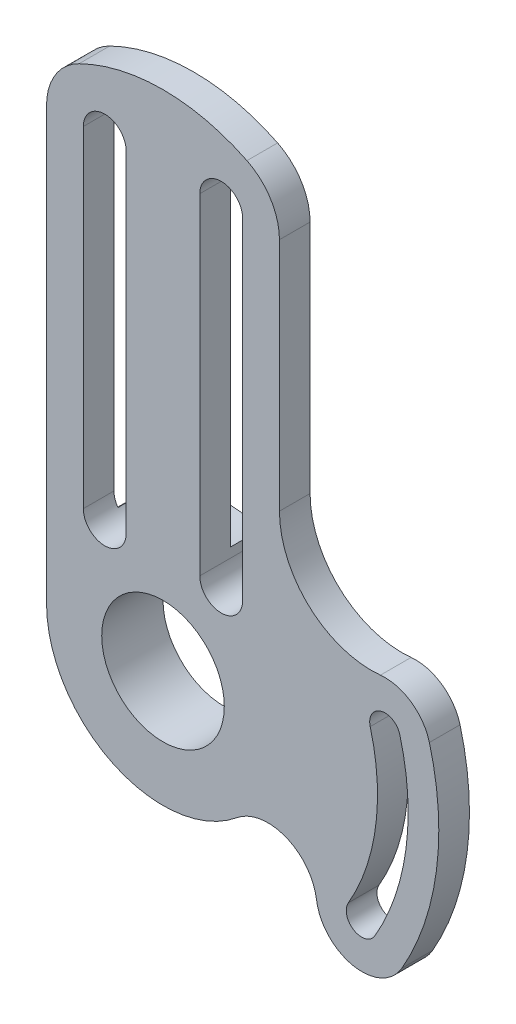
from build123d import *
from build123d.topology import SkipClean

# Parameters (mm, degrees)
ESQUISSE1_R             = 20
BOSS_EXTRU_1_DEPTH      = 10
BOSS_EXTRU_2_START      = 10
ESQUISSE3_R             = 38
ESQUISSE3_R_2           = 20
BOSS_EXTRU_2_DEPTH      = 10
ENL_V_MAT_EXTRU_1_DEPTH = 140.61692504


with BuildPart() as part:
    # Esquisse1 → Boss.-Extru.1 (new body)
    with BuildSketch(Plane.XY):
        with BuildLine():
            Line((0, 0), (0, 76.717552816))
            ThreePointArc((0, 76.717552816), (-2.867554, 86.754693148), (-10.604651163, 93.762144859))
            ThreePointArc((-10.604651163, 93.762144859), (-38, 100.142949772), (-65.395348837, 93.762144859))
            ThreePointArc((-65.395348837, 93.762144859), (-73.132446, 86.754693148), (-76, 76.717552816))
            Line((-76, 76.717552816), (-76, -64.191412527))
            ThreePointArc((-76, -64.191412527), (-54.252136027, -98.540620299), (-13.901680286, -93.57288606))
            ThreePointArc((-13.901680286, -93.57288606), (2.077425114, -91.044952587), (12.093715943, -103.74913202))
            ThreePointArc((12.093715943, -103.74913202), (24.074965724, -116.412934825), (39.942286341, -109.191412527))
            ThreePointArc((39.942286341, -109.191412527), (51.230037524, -75.938769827), (48.933324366, -40.897698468))
            ThreePointArc((48.933324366, -40.897698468), (42.976302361, -32.442752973), (32.962957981, -29.853322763))
            ThreePointArc((32.962957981, -29.853322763), (9.861588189, -22.236105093), (0, 0))
        make_face()
        with Locations((-38, -64.191412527)):
            Circle(ESQUISSE1_R, mode=Mode.SUBTRACT)
        with BuildLine():
            Line((-50, 76.717552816), (-50, -31.282447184))
            ThreePointArc((-50, -31.282447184), (-57, -38.282447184), (-64, -31.282447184))
            Line((-64, -31.282447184), (-64, 76.717552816))
            ThreePointArc((-64, 76.717552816), (-57, 83.717552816), (-50, 76.717552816))
        make_face(mode=Mode.SUBTRACT)
        with BuildLine():
            Line((-12, 76.717552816), (-12, -31.282447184))
            ThreePointArc((-12, -31.282447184), (-19, -38.282447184), (-26, -31.282447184))
            Line((-26, -31.282447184), (-26, 76.717552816))
            ThreePointArc((-26, 76.717552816), (-19, 83.717552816), (-12, 76.717552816))
        make_face(mode=Mode.SUBTRACT)
        with BuildLine():
            ThreePointArc((31.120577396, -104.469766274), (41.294427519, -74.793005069), (39.274066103, -43.485888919))
            ThreePointArc((39.274066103, -43.485888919), (33.150341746, -39.950355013), (29.61480784, -46.07407937))
            ThreePointArc((29.61480784, -46.07407937), (31.382624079, -73.467806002), (22.480505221, -99.434972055))
            ThreePointArc((22.480505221, -99.434972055), (24.283144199, -106.272405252), (31.120577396, -104.469766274))
        make_face(mode=Mode.SUBTRACT)
    extrude(amount=BOSS_EXTRU_1_DEPTH)

    # Esquisse3 → Boss.-Extru.2 (add)
    with SkipClean():  # the faces are left unmerged after this step: merging them gives an invalid solid
        with BuildSketch(Plane(origin=(0, 0, 0), x_dir=(-1, 0, 0), z_dir=(0, 0, -1)).offset(BOSS_EXTRU_2_START)):
            with Locations((38, -64.191412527)):
                Circle(ESQUISSE3_R)
            with Locations((38, -64.191412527)):
                Circle(ESQUISSE3_R_2, mode=Mode.SUBTRACT)
        extrude(amount=-BOSS_EXTRU_2_DEPTH)

    # Esquisse4 → Enl_v. mat.-Extru.1 (cut, through all)
    with SkipClean():  # the faces are left unmerged after this step: merging them gives an invalid solid
        with BuildSketch(Plane.XY):
            with BuildLine():
                Line((-26, -28.135899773), (-26, -31.282447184))
                ThreePointArc((-26, -31.282447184), (-21.121522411, -37.953214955), (-13.28595924, -35.325928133))
                ThreePointArc((-13.28595924, -35.325928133), (-19.294270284, -31.114295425), (-26, -28.135899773))
            make_face()
            with BuildLine():
                Line((-50, -28.135899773), (-50, -31.282447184))
                ThreePointArc((-50, -31.282447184), (-54.878477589, -37.953214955), (-62.71404076, -35.325928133))
                ThreePointArc((-62.71404076, -35.325928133), (-56.705729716, -31.114295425), (-50, -28.135899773))
            make_face()
        extrude(amount=-ENL_V_MAT_EXTRU_1_DEPTH, mode=Mode.SUBTRACT)


solid = part.part
